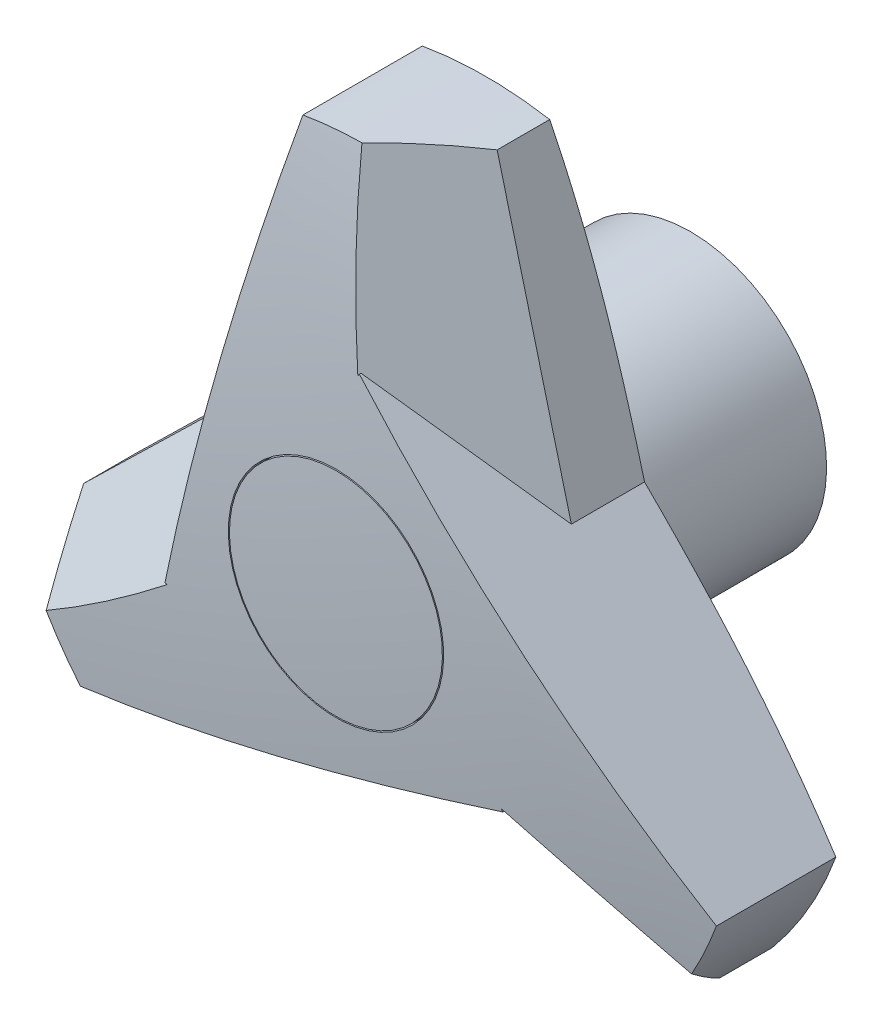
ISO-10303-21;
HEADER;
FILE_DESCRIPTION(('STEP AP214'),'2;1');
FILE_NAME('part.step','',(''),(''),'','','');
FILE_SCHEMA(('AUTOMOTIVE_DESIGN { 1 0 10303 214 1 1 1 1 }'));
ENDSEC;
DATA;
#1=APPLICATION_CONTEXT('core data for automotive mechanical design processes');
#2=APPLICATION_PROTOCOL_DEFINITION('international standard','automotive_design',2000,#1);
#3=PRODUCT_CONTEXT('',#1,'mechanical');
#4=PRODUCT('Part','Part','',(#3));
#5=PRODUCT_RELATED_PRODUCT_CATEGORY('part','',(#4));
#6=PRODUCT_DEFINITION_FORMATION('','',#4);
#7=PRODUCT_DEFINITION_CONTEXT('part definition',#1,'design');
#8=PRODUCT_DEFINITION('design','',#6,#7);
#9=PRODUCT_DEFINITION_SHAPE('','',#8);
#10=(LENGTH_UNIT() NAMED_UNIT(*) SI_UNIT(.MILLI.,.METRE.));
#11=(NAMED_UNIT(*) PLANE_ANGLE_UNIT() SI_UNIT($,.RADIAN.));
#12=(NAMED_UNIT(*) SI_UNIT($,.STERADIAN.) SOLID_ANGLE_UNIT());
#13=UNCERTAINTY_MEASURE_WITH_UNIT(LENGTH_MEASURE(1.E-05),#10,'distance_accuracy_value','');
#14=(GEOMETRIC_REPRESENTATION_CONTEXT(3) GLOBAL_UNCERTAINTY_ASSIGNED_CONTEXT((#13)) GLOBAL_UNIT_ASSIGNED_CONTEXT((#10,
#11,#12)) REPRESENTATION_CONTEXT('',''));
#15=CARTESIAN_POINT('',(0.,0.,0.));
#16=DIRECTION('',(0.,0.,1.));
#17=DIRECTION('',(1.,0.,0.));
#18=AXIS2_PLACEMENT_3D('',#15,#16,#17);
#19=CARTESIAN_POINT('',(0.,0.,145.669585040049));
#20=DIRECTION('',(0.,0.,-1.));
#21=DIRECTION('',(0.,1.,0.));
#22=AXIS2_PLACEMENT_3D('',#19,#20,#21);
#23=DEGENERATE_TOROIDAL_SURFACE('',#22,9.26275960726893,130.000000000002,.T.);
#24=CARTESIAN_POINT('',(0.,0.,17.5856081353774));
#25=DIRECTION('',(0.,0.,1.));
#26=DIRECTION('',(0.,-1.,0.));
#27=AXIS2_PLACEMENT_3D('',#24,#25,#26);
#28=CIRCLE('',#27,31.5);
#29=CARTESIAN_POINT('',(5.38147108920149,31.0369097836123,17.5856081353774));
#30=VERTEX_POINT('',#29);
#31=CARTESIAN_POINT('',(-5.38147108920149,31.0369097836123,17.5856081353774));
#32=VERTEX_POINT('',#31);
#33=EDGE_CURVE('E127',#30,#32,#28,.T.);
#34=ORIENTED_EDGE('',*,*,#33,.F.);
#35=CARTESIAN_POINT('',(11.544486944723,6.664983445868,15.7332351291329));
#36=CARTESIAN_POINT('',(11.4080792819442,7.20441374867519,15.7379922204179));
#37=CARTESIAN_POINT('',(11.2716740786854,7.74383432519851,15.7439991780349));
#38=CARTESIAN_POINT('',(10.9988716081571,8.82264409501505,15.7590912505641));
#39=CARTESIAN_POINT('',(10.8624743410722,9.36203328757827,15.7681764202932));
#40=CARTESIAN_POINT('',(10.4532787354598,10.9802159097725,15.8009188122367));
#41=CARTESIAN_POINT('',(10.1805041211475,12.0589155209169,15.8300621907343));
#42=CARTESIAN_POINT('',(9.63569132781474,14.213402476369,15.907195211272));
#43=CARTESIAN_POINT('',(9.36365281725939,15.289191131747,15.9551445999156));
#44=CARTESIAN_POINT('',(8.81986531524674,17.4396235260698,16.0729939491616));
#45=CARTESIAN_POINT('',(8.54811631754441,18.5142672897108,16.1428934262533));
#46=CARTESIAN_POINT('',(7.91814935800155,21.0055002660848,16.3329424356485));
#47=CARTESIAN_POINT('',(7.56008936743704,22.4214647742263,16.4620143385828));
#48=CARTESIAN_POINT('',(6.8450977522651,25.2489316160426,16.7648798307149));
#49=CARTESIAN_POINT('',(6.48816615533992,26.6604338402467,16.9386745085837));
#50=CARTESIAN_POINT('',(5.77484979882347,29.4812757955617,17.3330237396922));
#51=CARTESIAN_POINT('',(5.41846922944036,30.8905989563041,17.5537053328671));
#52=CARTESIAN_POINT('',(4.88536539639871,32.9987822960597,17.920159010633));
#53=CARTESIAN_POINT('',(4.70790109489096,33.7005729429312,18.0482216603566));
#54=CARTESIAN_POINT('',(4.35351036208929,35.1020272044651,18.3162059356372));
#55=CARTESIAN_POINT('',(4.17658393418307,35.8016908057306,18.4561276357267));
#56=CARTESIAN_POINT('',(3.99994942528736,36.5002,18.6020030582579));
#57=B_SPLINE_CURVE_WITH_KNOTS('',3,(#35,#36,#37,#38,#39,#40,#41,#42,#43,#44,#45,#46,#47,#48,#49,
#50,#51,#52,#53,#54,#55,#56),.UNSPECIFIED.,.F.,.F.,(4,2,2,2,2,2,2,2,2,2,4),(0.,1.6692892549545,
3.3386082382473,6.67758305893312,10.009449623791,13.3412428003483,17.7392456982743,
22.1373556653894,26.547537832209,28.7528167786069,30.9581095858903),.UNSPECIFIED.);
#58=CARTESIAN_POINT('',(11.5444363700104,6.66518344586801,15.7332368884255));
#59=VERTEX_POINT('',#58);
#60=EDGE_CURVE('E143',#59,#30,#57,.T.);
#61=ORIENTED_EDGE('',*,*,#60,.F.);
#62=CARTESIAN_POINT('',(33.610127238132,-14.7860928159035,18.6020177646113));
#63=CARTESIAN_POINT('',(33.102807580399,-14.2928993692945,18.4587652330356));
#64=CARTESIAN_POINT('',(32.5946644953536,-13.7989054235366,18.321253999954));
#65=CARTESIAN_POINT('',(31.5768586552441,-12.8094401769,18.0576688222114));
#66=CARTESIAN_POINT('',(31.0671959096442,-12.313968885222,17.931594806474));
#67=CARTESIAN_POINT('',(29.5362038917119,-10.8256070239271,17.5704803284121));
#68=CARTESIAN_POINT('',(28.5127769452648,-9.83067718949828,17.3525209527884));
#69=CARTESIAN_POINT('',(26.4639502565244,-7.83889965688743,16.9619085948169));
#70=CARTESIAN_POINT('',(25.438560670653,-6.84206183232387,16.789151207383));
#71=CARTESIAN_POINT('',(23.3845091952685,-4.84520499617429,16.4869004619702));
#72=CARTESIAN_POINT('',(22.3558473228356,-3.84518600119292,16.3574068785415));
#73=CARTESIAN_POINT('',(20.8129760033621,-2.34527561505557,16.1938410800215));
#74=CARTESIAN_POINT('',(20.2995699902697,-1.84616528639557,16.1444890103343));
#75=CARTESIAN_POINT('',(19.2723312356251,-0.847529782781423,16.0553618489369));
#76=CARTESIAN_POINT('',(18.7584984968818,-0.348004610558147,16.0155866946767));
#77=CARTESIAN_POINT('',(17.7305139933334,0.65135587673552,15.9449651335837));
#78=CARTESIAN_POINT('',(17.2163622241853,1.15119119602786,15.9141188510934));
#79=CARTESIAN_POINT('',(16.1878443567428,2.15107019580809,15.8605067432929));
#80=CARTESIAN_POINT('',(15.6734782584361,2.65111387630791,15.8377409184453));
#81=CARTESIAN_POINT('',(14.6443750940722,3.65156187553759,15.7992279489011));
#82=CARTESIAN_POINT('',(14.1296379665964,4.15196625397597,15.7834840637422));
#83=CARTESIAN_POINT('',(13.1000904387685,5.15284624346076,15.7578127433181));
#84=CARTESIAN_POINT('',(12.5852800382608,5.65332185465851,15.7478853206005));
#85=CARTESIAN_POINT('',(11.5556289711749,6.654302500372,15.7326205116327));
#86=CARTESIAN_POINT('',(11.0407883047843,7.15480753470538,15.7272830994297));
#87=CARTESIAN_POINT('',(10.0110960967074,8.15582817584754,15.7202321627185));
#88=CARTESIAN_POINT('',(9.49624455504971,8.65634378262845,15.7185186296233));
#89=CARTESIAN_POINT('',(8.66716640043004,9.46233642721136,15.7183844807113));
#90=CARTESIAN_POINT('',(8.35293965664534,9.76781359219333,15.7189408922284));
#91=CARTESIAN_POINT('',(7.7244912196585,10.3787630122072,15.721325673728));
#92=CARTESIAN_POINT('',(7.41026952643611,10.6842352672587,15.7231540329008));
#93=CARTESIAN_POINT('',(6.78189069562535,11.295117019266,15.7282192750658));
#94=CARTESIAN_POINT('',(6.46773355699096,11.6005265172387,15.7314558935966));
#95=CARTESIAN_POINT('',(5.8394293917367,12.2113356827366,15.7395521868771));
#96=CARTESIAN_POINT('',(5.52528236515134,12.5167353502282,15.7444118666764));
#97=CARTESIAN_POINT('',(4.58216068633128,13.4335960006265,15.761829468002));
#98=CARTESIAN_POINT('',(3.95320939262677,14.0450342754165,15.7772213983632));
#99=CARTESIAN_POINT('',(3.00983753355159,14.9621381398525,15.8076660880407));
#100=CARTESIAN_POINT('',(2.69535530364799,15.2678636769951,15.8190420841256));
#101=CARTESIAN_POINT('',(2.06644408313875,15.8792629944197,15.8445058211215));
#102=CARTESIAN_POINT('',(1.75201509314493,16.1849367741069,15.8585935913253));
#103=CARTESIAN_POINT('',(1.43762217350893,16.4905754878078,15.8741667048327));
#104=B_SPLINE_CURVE_WITH_KNOTS('',3,(#62,#63,#64,#65,#66,#67,#68,#69,#70,#71,#72,#73,#74,#75,
#76,#77,#78,#79,#80,#81,#82,#83,#84,#85,#86,#87,#88,#89,#90,#91,#92,#93,#94,#95,#96,#97,#98,#99,
#100,#101,#102,#103),.UNSPECIFIED.,.F.,.F.,(4,2,2,2,2,2,2,2,2,2,2,2,2,2,2,2,2,2,2,2,4),(0.,
2.16563848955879,4.33126351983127,8.66211296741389,12.9828691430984,17.3036028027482,
19.4567324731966,21.6098480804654,23.7629936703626,25.9161393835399,28.0702835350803,
30.2244323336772,32.3785689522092,34.532700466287,35.8474215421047,37.1621314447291,
38.4765945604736,39.7910617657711,42.4229414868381,43.7391670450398,45.0554068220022),.UNSPECIFIED.);
#105=CARTESIAN_POINT('',(29.5694878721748,-10.8579642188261,17.5856081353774));
#106=VERTEX_POINT('',#105);
#107=EDGE_CURVE('E142',#106,#59,#104,.T.);
#108=ORIENTED_EDGE('',*,*,#107,.F.);
#109=CARTESIAN_POINT('',(24.1880167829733,-20.1789455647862,17.5856081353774));
#110=VERTEX_POINT('',#109);
#111=EDGE_CURVE('E22',#110,#106,#28,.T.);
#112=ORIENTED_EDGE('',*,*,#111,.F.);
#113=CARTESIAN_POINT('',(-0.000199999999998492,-13.3303102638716,15.7332351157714));
#114=CARTESIAN_POINT('',(0.535164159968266,-13.4818929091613,15.737992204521));
#115=CARTESIAN_POINT('',(1.07051866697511,-13.633472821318,15.7439991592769));
#116=CARTESIAN_POINT('',(2.14119653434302,-13.9366238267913,15.7590912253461));
#117=CARTESIAN_POINT('',(2.67651989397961,-14.0881949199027,15.7681763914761));
#118=CARTESIAN_POINT('',(4.28250490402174,-14.5429124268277,15.8009187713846));
#119=CARTESIAN_POINT('',(5.35307344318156,-14.8460324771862,15.8300621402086));
#120=CARTESIAN_POINT('',(7.49132020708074,-15.4514542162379,15.9071951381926));
#121=CARTESIAN_POINT('',(8.55899973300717,-15.7537562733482,15.955144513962));
#122=CARTESIAN_POINT('',(10.6932224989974,-16.3580386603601,16.0729938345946));
#123=CARTESIAN_POINT('',(11.7597657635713,-16.6600189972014,16.1428932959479));
#124=CARTESIAN_POINT('',(14.2322205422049,-17.3600681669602,16.3329422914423));
#125=CARTESIAN_POINT('',(15.6375120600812,-17.7579614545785,16.462014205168));
#126=CARTESIAN_POINT('',(18.4436665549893,-18.552494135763,16.7648797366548));
#127=CARTESIAN_POINT('',(19.8445294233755,-18.9491334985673,16.9386744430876));
#128=CARTESIAN_POINT('',(22.644108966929,-19.7418045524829,17.3330237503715));
#129=CARTESIAN_POINT('',(24.0428091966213,-20.1378315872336,17.5537053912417));
#130=CARTESIAN_POINT('',(26.1351018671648,-20.7302419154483,17.920159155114));
#131=CARTESIAN_POINT('',(26.8316026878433,-20.9274486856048,18.0482218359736));
#132=CARTESIAN_POINT('',(28.2224933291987,-21.3212645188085,18.3162061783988));
#133=CARTESIAN_POINT('',(28.9168831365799,-21.5178735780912,18.4561279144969));
#134=CARTESIAN_POINT('',(29.610127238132,-21.7141582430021,18.602003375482));
#135=B_SPLINE_CURVE_WITH_KNOTS('',3,(#113,#114,#115,#116,#117,#118,#119,#120,#121,#122,#123,
#124,#125,#126,#127,#128,#129,#130,#131,#132,#133,#134),.UNSPECIFIED.,.F.,.F.,(4,2,2,2,2,2,2,2,
2,2,4),(0.,1.66928920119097,3.33860813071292,6.6775828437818,10.0094493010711,13.3412423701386,
17.7392461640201,22.1373570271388,26.5475400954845,28.7528194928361,30.9581127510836),.UNSPECIFIED.);
#136=CARTESIAN_POINT('',(0.,-13.330366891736,15.7332368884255));
#137=VERTEX_POINT('',#136);
#138=EDGE_CURVE('E140',#137,#110,#135,.T.);
#139=ORIENTED_EDGE('',*,*,#138,.F.);
#140=CARTESIAN_POINT('',(-29.610127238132,-21.7141582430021,18.602003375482));
#141=CARTESIAN_POINT('',(-28.9293507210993,-21.5214036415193,18.4587515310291));
#142=CARTESIAN_POINT('',(-28.2474692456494,-21.3283361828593,18.3212409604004));
#143=CARTESIAN_POINT('',(-26.881667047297,-20.9416238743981,18.0576570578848));
#144=CARTESIAN_POINT('',(-26.1977463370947,-20.7479790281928,17.9315836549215));
#145=CARTESIAN_POINT('',(-24.1432953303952,-20.1662831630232,17.5704709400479));
#146=CARTESIAN_POINT('',(-22.7699501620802,-19.7774351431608,17.3525126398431));
#147=CARTESIAN_POINT('',(-20.0206125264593,-18.9989895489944,16.9619022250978));
#148=CARTESIAN_POINT('',(-18.6446336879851,-18.6093958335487,16.7891457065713));
#149=CARTESIAN_POINT('',(-15.888284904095,-17.8289651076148,16.4868964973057));
#150=CARTESIAN_POINT('',(-14.5079149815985,-17.438128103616,16.3574035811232));
#151=CARTESIAN_POINT('',(-12.4375231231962,-16.8519187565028,16.193838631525));
#152=CARTESIAN_POINT('',(-11.7485793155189,-16.656851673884,16.14448681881));
#153=CARTESIAN_POINT('',(-10.3701190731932,-16.2665553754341,16.0553601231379));
#154=CARTESIAN_POINT('',(-9.68060264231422,-16.0713261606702,16.0155851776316));
#155=CARTESIAN_POINT('',(-8.3011416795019,-15.6807465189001,15.9449639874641));
#156=CARTESIAN_POINT('',(-7.61119714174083,-15.4853960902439,15.9141178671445));
#157=CARTESIAN_POINT('',(-6.23102045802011,-15.0946137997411,15.86050604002));
#158=CARTESIAN_POINT('',(-5.54078831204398,-14.8991819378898,15.8377403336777));
#159=CARTESIAN_POINT('',(-4.1598262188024,-14.5081772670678,15.7992275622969));
#160=CARTESIAN_POINT('',(-3.46909618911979,-14.3126044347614,15.7834837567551));
#161=CARTESIAN_POINT('',(-2.08753780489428,-13.9214309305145,15.7578125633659));
#162=CARTESIAN_POINT('',(-1.39670945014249,-13.7258302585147,15.747885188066));
#163=CARTESIAN_POINT('',(-0.0150121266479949,-13.3346174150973,15.7326204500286));
#164=CARTESIAN_POINT('',(0.675856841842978,-13.1390052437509,15.7272830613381));
#165=CARTESIAN_POINT('',(2.05760937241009,-12.7477767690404,15.7202321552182));
#166=CARTESIAN_POINT('',(2.74849293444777,-12.5521604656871,15.7185186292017));
#167=CARTESIAN_POINT('',(3.86103782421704,-12.237155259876,15.7183844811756));
#168=CARTESIAN_POINT('',(4.28269932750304,-12.1177663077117,15.7189408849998));
#169=CARTESIAN_POINT('',(5.12601555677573,-11.8789903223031,15.7213256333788));
#170=CARTESIAN_POINT('',(5.54767028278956,-11.7596032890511,15.7231539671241));
#171=CARTESIAN_POINT('',(6.39089310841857,-11.5208537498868,15.7282191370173));
#172=CARTESIAN_POINT('',(6.81246120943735,-11.4014912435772,15.7314557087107));
#173=CARTESIAN_POINT('',(7.65558384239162,-11.1627700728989,15.7395518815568));
#174=CARTESIAN_POINT('',(8.07713837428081,-11.0434114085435,15.7444114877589));
#175=CARTESIAN_POINT('',(9.34271525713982,-10.6850768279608,15.7618288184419));
#176=CARTESIAN_POINT('',(10.1867062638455,-10.4461097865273,15.7772205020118));
#177=CARTESIAN_POINT('',(11.4526188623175,-10.0876801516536,15.8076646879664));
#178=CARTESIAN_POINT('',(11.8746232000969,-9.96819412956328,15.8190404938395));
#179=CARTESIAN_POINT('',(12.7185604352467,-9.72924231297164,15.8445038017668));
#180=CARTESIAN_POINT('',(13.1404933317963,-9.60977651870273,15.8585913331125));
#181=CARTESIAN_POINT('',(13.5623778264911,-9.49032442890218,15.8741641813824));
#182=B_SPLINE_CURVE_WITH_KNOTS('',3,(#140,#141,#142,#143,#144,#145,#146,#147,#148,#149,#150,
#151,#152,#153,#154,#155,#156,#157,#158,#159,#160,#161,#162,#163,#164,#165,#166,#167,#168,#169,
#170,#171,#172,#173,#174,#175,#176,#177,#178,#179,#180,#181),.UNSPECIFIED.,.F.,.F.,(4,2,2,2,2,2,
2,2,2,2,2,2,2,2,2,2,2,2,2,2,4),(0.,2.16563390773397,4.33125435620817,8.66209464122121,
12.9828417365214,17.3035663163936,19.4566915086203,21.6098026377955,23.7629437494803,
25.9160849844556,28.070224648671,30.2243689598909,32.378501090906,34.5326281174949,
35.8473402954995,37.162041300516,38.4764955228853,39.7909538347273,42.4228157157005,
43.7390323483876,45.0552631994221),.UNSPECIFIED.);
#183=CARTESIAN_POINT('',(-24.1880167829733,-20.1789455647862,17.5856081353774));
#184=VERTEX_POINT('',#183);
#185=EDGE_CURVE('E132',#184,#137,#182,.T.);
#186=ORIENTED_EDGE('',*,*,#185,.F.);
#187=CARTESIAN_POINT('',(-29.5694878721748,-10.8579642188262,17.5856081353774));
#188=VERTEX_POINT('',#187);
#189=EDGE_CURVE('E118',#188,#184,#28,.T.);
#190=ORIENTED_EDGE('',*,*,#189,.F.);
#191=CARTESIAN_POINT('',(-11.5442363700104,6.6653778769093,15.7332345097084));
#192=CARTESIAN_POINT('',(-11.9431922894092,6.27753080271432,15.7379914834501));
#193=CARTESIAN_POINT('',(-12.342141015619,5.88969072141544,15.7439983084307));
#194=CARTESIAN_POINT('',(-13.1400152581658,5.11403312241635,15.7590900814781));
#195=CARTESIAN_POINT('',(-13.5389407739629,4.72621560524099,15.7681750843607));
#196=CARTESIAN_POINT('',(-14.7357284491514,3.56275223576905,15.8009169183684));
#197=CARTESIAN_POINT('',(-15.5335212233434,2.78717383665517,15.8300598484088));
#198=CARTESIAN_POINT('',(-17.1269529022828,1.23811093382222,15.9071918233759));
#199=CARTESIAN_POINT('',(-17.9225927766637,0.464625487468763,15.9551406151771));
#200=CARTESIAN_POINT('',(-19.5130257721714,-1.08152222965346,16.0729886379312));
#201=CARTESIAN_POINT('',(-20.3078189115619,-1.85418451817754,16.1428873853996));
#202=CARTESIAN_POINT('',(-22.1503152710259,-3.64537694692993,16.3329357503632));
#203=CARTESIAN_POINT('',(-23.1975564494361,-4.66345791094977,16.4620081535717));
#204=CARTESIAN_POINT('',(-25.2887385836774,-6.6964115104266,16.7648754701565));
#205=CARTESIAN_POINT('',(-26.3326794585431,-7.71128406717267,16.9386714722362));
#206=CARTESIAN_POINT('',(-28.4189618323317,-9.739474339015,17.3330242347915));
#207=CARTESIAN_POINT('',(-29.4612910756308,-10.7527801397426,17.553708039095));
#208=CARTESIAN_POINT('',(-31.0204942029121,-12.2685675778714,17.9201657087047));
#209=CARTESIAN_POINT('',(-31.539535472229,-12.7731562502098,18.0482298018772));
#210=CARTESIAN_POINT('',(-32.5760448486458,-13.780804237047,18.3162171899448));
#211=CARTESIAN_POINT('',(-33.0935129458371,-14.2838635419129,18.4561405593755));
#212=CARTESIAN_POINT('',(-33.610127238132,-14.7860928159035,18.6020177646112));
#213=B_SPLINE_CURVE_WITH_KNOTS('',3,(#191,#192,#193,#194,#195,#196,#197,#198,#199,#200,#201,
#202,#203,#204,#205,#206,#207,#208,#209,#210,#211,#212),.UNSPECIFIED.,.F.,.F.,(4,2,2,2,2,2,2,2,
2,2,4),(0.,1.66928676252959,3.33860325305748,6.67757308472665,10.0094346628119,13.3412228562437,
17.7392672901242,22.1374187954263,26.5476427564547,28.7529426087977,30.9582563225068),.UNSPECIFIED.);
#214=CARTESIAN_POINT('',(-11.5444363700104,6.665183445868,15.7332368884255));
#215=VERTEX_POINT('',#214);
#216=EDGE_CURVE('E128',#215,#188,#213,.T.);
#217=ORIENTED_EDGE('',*,*,#216,.F.);
#218=CARTESIAN_POINT('',(-3.99994942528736,36.5002,18.6020030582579));
#219=CARTESIAN_POINT('',(-4.17340729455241,35.8142529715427,18.4587512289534));
#220=CARTESIAN_POINT('',(-4.34714670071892,35.1271925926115,18.3212406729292));
#221=CARTESIAN_POINT('',(-4.69514510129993,33.7510170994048,18.0576567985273));
#222=CARTESIAN_POINT('',(-4.8694040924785,33.0619019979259,17.9315834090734));
#223=CARTESIAN_POINT('',(-5.39286617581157,30.9918473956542,17.5704707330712));
#224=CARTESIAN_POINT('',(-5.74278648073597,29.6080716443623,17.3525124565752));
#225=CARTESIAN_POINT('',(-6.44330160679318,26.8378527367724,16.9619020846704));
#226=CARTESIAN_POINT('',(-6.79389295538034,25.4514233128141,16.7891455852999));
#227=CARTESIAN_POINT('',(-7.49619448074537,22.6741400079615,16.4868964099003));
#228=CARTESIAN_POINT('',(-7.8479046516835,21.2832861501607,16.357403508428));
#229=CARTESIAN_POINT('',(-8.37542837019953,19.1971696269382,16.1938385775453));
#230=CARTESIAN_POINT('',(-8.55096721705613,18.5029932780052,16.1444867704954));
#231=CARTESIAN_POINT('',(-8.90219081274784,17.1140636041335,16.0553600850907));
#232=CARTESIAN_POINT('',(-9.07787556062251,16.4193102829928,16.0155851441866));
#233=CARTESIAN_POINT('',(-9.42935413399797,15.0293722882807,15.9449639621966));
#234=CARTESIAN_POINT('',(-9.60514796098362,14.3341876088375,15.9141178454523));
#235=CARTESIAN_POINT('',(-9.95680889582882,12.9435284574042,15.8605060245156));
#236=CARTESIAN_POINT('',(-10.1326760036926,12.2480539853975,15.8377403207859));
#237=CARTESIAN_POINT('',(-10.4845370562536,10.8566034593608,15.7992275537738));
#238=CARTESIAN_POINT('',(-10.6605310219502,10.1606273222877,15.7834837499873));
#239=CARTESIAN_POINT('',(-11.0125440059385,8.76857597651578,15.7578125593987));
#240=CARTESIAN_POINT('',(-11.1885630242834,8.07250076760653,15.7478851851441));
#241=CARTESIAN_POINT('',(-11.5406114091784,6.68030942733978,15.7326204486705));
#242=CARTESIAN_POINT('',(-11.7166407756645,5.98419329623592,15.7272830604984));
#243=CARTESIAN_POINT('',(-12.0687032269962,4.59194632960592,15.7202321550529));
#244=CARTESIAN_POINT('',(-12.2447363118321,3.89581549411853,15.7185186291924));
#245=CARTESIAN_POINT('',(-12.5282062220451,2.77482084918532,15.7183844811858));
#246=CARTESIAN_POINT('',(-12.6356430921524,2.34995686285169,15.7189408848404));
#247=CARTESIAN_POINT('',(-12.8505151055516,1.50023571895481,15.7213256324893));
#248=CARTESIAN_POINT('',(-12.9579502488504,1.0753785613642,15.723153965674));
#249=CARTESIAN_POINT('',(-13.1727984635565,0.225751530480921,15.7282191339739));
#250=CARTESIAN_POINT('',(-13.2802115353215,-0.199018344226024,15.7314557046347));
#251=CARTESIAN_POINT('',(-13.4950342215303,-1.04854442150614,15.7395518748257));
#252=CARTESIAN_POINT('',(-13.6024438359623,-1.47330062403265,15.7444114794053));
#253=CARTESIAN_POINT('',(-13.9249053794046,-2.74848945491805,15.7618288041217));
#254=CARTESIAN_POINT('',(-14.1399493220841,-3.59889050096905,15.7772204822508));
#255=CARTESIAN_POINT('',(-14.4624964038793,-4.8744175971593,15.8076646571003));
#256=CARTESIAN_POINT('',(-14.5700206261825,-5.29962702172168,15.8190404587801));
#257=CARTESIAN_POINT('',(-14.7850508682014,-6.14997388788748,15.8445037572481));
#258=CARTESIAN_POINT('',(-14.8925568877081,-6.5751113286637,15.858591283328));
#259=CARTESIAN_POINT('',(-15.0000505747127,-7.0002,15.8741641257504));
#260=B_SPLINE_CURVE_WITH_KNOTS('',3,(#218,#219,#220,#221,#222,#223,#224,#225,#226,#227,#228,
#229,#230,#231,#232,#233,#234,#235,#236,#237,#238,#239,#240,#241,#242,#243,#244,#245,#246,#247,
#248,#249,#250,#251,#252,#253,#254,#255,#256,#257,#258,#259),.UNSPECIFIED.,.F.,.F.,(4,2,2,2,2,2,
2,2,2,2,2,2,2,2,2,2,2,2,2,2,4),(0.,2.16563380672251,4.33125415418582,8.66209423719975,
12.9828411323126,17.3035655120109,19.4566906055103,21.6098016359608,23.7629426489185,
25.9160837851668,28.070223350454,30.2243675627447,32.3784995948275,34.5326265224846,
35.8473385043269,37.1620393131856,38.4764933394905,39.7909514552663,42.4228129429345,
43.7390293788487,45.055260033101),.UNSPECIFIED.);
#261=EDGE_CURVE('E147',#32,#215,#260,.T.);
#262=ORIENTED_EDGE('',*,*,#261,.F.);
#263=EDGE_LOOP('',(#34,#61,#108,#112,#139,#186,#190,#217,#262));
#264=FACE_BOUND('',#263,.T.);
#265=CARTESIAN_POINT('',(0.,0.,15.6888374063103));
#266=DIRECTION('',(0.,0.,1.));
#267=DIRECTION('',(0.,-1.,0.));
#268=AXIS2_PLACEMENT_3D('',#265,#266,#267);
#269=CIRCLE('',#268,11.5);
#270=CARTESIAN_POINT('',(0.,-11.5,15.6888374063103));
#271=VERTEX_POINT('',#270);
#272=EDGE_CURVE('E9',#271,#271,#269,.T.);
#273=ORIENTED_EDGE('',*,*,#272,.T.);
#274=EDGE_LOOP('',(#273));
#275=FACE_BOUND('',#274,.T.);
#276=ADVANCED_FACE('F14',(#264,#275),#23,.T.);
#277=CARTESIAN_POINT('',(-4.85177827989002,-16.8675659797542,17.0336297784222));
#278=DIRECTION('',(-0.198370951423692,-0.689651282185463,0.696441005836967));
#279=DIRECTION('',(0.,-0.710561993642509,-0.703634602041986));
#280=AXIS2_PLACEMENT_3D('',#277,#278,#279);
#281=PLANE('',#280);
#282=CARTESIAN_POINT('',(0.,0.,35.118708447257));
#283=DIRECTION('',(-0.198370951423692,-0.689651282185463,0.696441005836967));
#284=DIRECTION('',(-0.19251806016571,-0.66930327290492,-0.717614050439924));
#285=AXIS2_PLACEMENT_3D('',#282,#283,#284);
#286=ELLIPSE('',#285,45.2299616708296,31.5);
#287=CARTESIAN_POINT('',(27.4724471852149,-15.4115101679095,27.6825692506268));
#288=VERTEX_POINT('',#287);
#289=CARTESIAN_POINT('',(24.1880167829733,-20.1789455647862,22.026090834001));
#290=VERTEX_POINT('',#289);
#291=EDGE_CURVE('E195',#288,#290,#286,.F.);
#292=ORIENTED_EDGE('',*,*,#291,.F.);
#293=CARTESIAN_POINT('',(-25.1603670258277,-87.4718765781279,-58.6669492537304));
#294=DIRECTION('',(-0.198370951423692,-0.689651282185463,0.696441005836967));
#295=DIRECTION('',(0.,-0.710561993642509,-0.703634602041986));
#296=AXIS2_PLACEMENT_3D('',#293,#294,#295);
#297=CIRCLE('',#296,124.173865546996);
#298=CARTESIAN_POINT('',(13.4491335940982,-9.29458270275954,29.7455276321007));
#299=VERTEX_POINT('',#298);
#300=EDGE_CURVE('E249',#288,#299,#297,.T.);
#301=ORIENTED_EDGE('',*,*,#300,.T.);
#302=DIRECTION('',(0.406697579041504,-0.704420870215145,-0.581711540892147));
#303=VECTOR('',#302,1.);
#304=CARTESIAN_POINT('',(15.5990543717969,-13.0183547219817,26.6704325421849));
#305=LINE('',#304,#303);
#306=CARTESIAN_POINT('',(13.5621778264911,-9.49038105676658,29.5838371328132));
#307=VERTEX_POINT('',#306);
#308=EDGE_CURVE('E274',#299,#307,#305,.T.);
#309=ORIENTED_EDGE('',*,*,#308,.T.);
#310=DIRECTION('',(0.845264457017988,0.239327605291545,0.477755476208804));
#311=VECTOR('',#310,1.);
#312=CARTESIAN_POINT('',(-6.15459352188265,-15.0729743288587,18.439637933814));
#313=LINE('',#312,#311);
#314=CARTESIAN_POINT('',(0.,-13.330366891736,21.9183016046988));
#315=VERTEX_POINT('',#314);
#316=EDGE_CURVE('E265',#315,#307,#313,.T.);
#317=ORIENTED_EDGE('',*,*,#316,.F.);
#318=DIRECTION('',(0.962166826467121,-0.272427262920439,0.00428771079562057));
#319=VECTOR('',#318,1.);
#320=CARTESIAN_POINT('',(-13.5621778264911,-9.49038105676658,21.8578643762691));
#321=LINE('',#320,#319);
#322=EDGE_CURVE('E279',#315,#290,#321,.T.);
#323=ORIENTED_EDGE('',*,*,#322,.T.);
#324=EDGE_LOOP('',(#292,#301,#309,#317,#323));
#325=FACE_BOUND('',#324,.T.);
#326=ADVANCED_FACE('F174',(#325),#281,.T.);
#327=CARTESIAN_POINT('',(17.0336297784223,4.23201974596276,17.0336297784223));
#328=DIRECTION('',(0.696441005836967,0.173031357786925,0.696441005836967));
#329=DIRECTION('',(-0.707106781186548,0.,0.707106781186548));
#330=AXIS2_PLACEMENT_3D('',#327,#328,#329);
#331=PLANE('',#330);
#332=CARTESIAN_POINT('',(0.,0.,35.118708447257));
#333=DIRECTION('',(0.696441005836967,0.173031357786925,0.696441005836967));
#334=DIRECTION('',(0.675892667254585,0.167926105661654,-0.717614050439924));
#335=AXIS2_PLACEMENT_3D('',#332,#333,#334);
#336=ELLIPSE('',#335,45.2299616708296,31.5);
#337=CARTESIAN_POINT('',(-0.389464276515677,31.4975922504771,27.6825692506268));
#338=VERTEX_POINT('',#337);
#339=CARTESIAN_POINT('',(5.38147108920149,31.0369097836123,22.026090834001));
#340=VERTEX_POINT('',#339);
#341=EDGE_CURVE('E357',#338,#340,#336,.F.);
#342=ORIENTED_EDGE('',*,*,#341,.F.);
#343=CARTESIAN_POINT('',(88.3330507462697,21.9464212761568,-58.6669492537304));
#344=DIRECTION('',(0.696441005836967,0.173031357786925,0.696441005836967));
#345=DIRECTION('',(-0.707106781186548,0.,0.707106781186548));
#346=AXIS2_PLACEMENT_3D('',#343,#344,#345);
#347=CIRCLE('',#346,124.173865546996);
#348=CARTESIAN_POINT('',(1.32477794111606,16.2945827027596,29.7455276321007));
#349=VERTEX_POINT('',#348);
#350=EDGE_CURVE('E247',#338,#349,#347,.T.);
#351=ORIENTED_EDGE('',*,*,#350,.T.);
#352=DIRECTION('',(0.406697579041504,0.704420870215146,-0.581711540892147));
#353=VECTOR('',#352,1.);
#354=CARTESIAN_POINT('',(3.47469871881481,20.0183547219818,26.6704325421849));
#355=LINE('',#354,#353);
#356=CARTESIAN_POINT('',(1.43782217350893,16.4903810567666,29.5838371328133));
#357=VERTEX_POINT('',#356);
#358=EDGE_CURVE('E282',#349,#357,#355,.T.);
#359=ORIENTED_EDGE('',*,*,#358,.T.);
#360=DIRECTION('',(-0.629896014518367,0.612356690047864,0.477755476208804));
#361=VECTOR('',#360,1.);
#362=CARTESIAN_POINT('',(16.1308754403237,2.20645282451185,18.439637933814));
#363=LINE('',#362,#361);
#364=CARTESIAN_POINT('',(11.5444363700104,6.665183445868,21.9183016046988));
#365=VERTEX_POINT('',#364);
#366=EDGE_CURVE('E291',#365,#357,#363,.T.);
#367=ORIENTED_EDGE('',*,*,#366,.F.);
#368=DIRECTION('',(0.245154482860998,-0.9694745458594,-0.00428771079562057));
#369=VECTOR('',#368,1.);
#370=CARTESIAN_POINT('',(4.,36.5,22.0502525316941));
#371=LINE('',#370,#369);
#372=EDGE_CURVE('E287',#340,#365,#371,.T.);
#373=ORIENTED_EDGE('',*,*,#372,.F.);
#374=EDGE_LOOP('',(#342,#351,#359,#367,#373));
#375=FACE_BOUND('',#374,.T.);
#376=ADVANCED_FACE('F204',(#375),#331,.T.);
#377=CARTESIAN_POINT('',(-12.1818514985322,12.6355462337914,17.0336297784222));
#378=DIRECTION('',(-0.498070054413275,0.516619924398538,0.696441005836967));
#379=DIRECTION('',(0.,-0.803150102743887,0.595776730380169));
#380=AXIS2_PLACEMENT_3D('',#377,#378,#379);
#381=PLANE('',#380);
#382=CARTESIAN_POINT('',(0.,0.,35.118708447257));
#383=DIRECTION('',(-0.498070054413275,0.516619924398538,0.696441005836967));
#384=DIRECTION('',(-0.483374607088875,0.501377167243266,-0.717614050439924));
#385=AXIS2_PLACEMENT_3D('',#382,#383,#384);
#386=ELLIPSE('',#385,45.2299616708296,31.5);
#387=CARTESIAN_POINT('',(-27.0829829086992,-16.0860820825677,27.6825692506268));
#388=VERTEX_POINT('',#387);
#389=CARTESIAN_POINT('',(-29.5694878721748,-10.8579642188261,22.026090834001));
#390=VERTEX_POINT('',#389);
#391=EDGE_CURVE('E365',#388,#390,#386,.F.);
#392=ORIENTED_EDGE('',*,*,#391,.F.);
#393=CARTESIAN_POINT('',(-63.1726837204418,65.5254553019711,-58.6669492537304));
#394=DIRECTION('',(-0.498070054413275,0.516619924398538,0.696441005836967));
#395=DIRECTION('',(0.,-0.803150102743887,0.595776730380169));
#396=AXIS2_PLACEMENT_3D('',#393,#394,#395);
#397=CIRCLE('',#396,124.173865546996);
#398=CARTESIAN_POINT('',(-14.7739115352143,-7.,29.7455276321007));
#399=VERTEX_POINT('',#398);
#400=EDGE_CURVE('E236',#388,#399,#397,.T.);
#401=ORIENTED_EDGE('',*,*,#400,.T.);
#402=DIRECTION('',(-0.813395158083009,0.,-0.581711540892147));
#403=VECTOR('',#402,1.);
#404=CARTESIAN_POINT('',(-19.0737530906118,-7.,26.6704325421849));
#405=LINE('',#404,#403);
#406=CARTESIAN_POINT('',(-15.,-7.,29.5838371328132));
#407=VERTEX_POINT('',#406);
#408=EDGE_CURVE('E271',#399,#407,#405,.T.);
#409=ORIENTED_EDGE('',*,*,#408,.T.);
#410=DIRECTION('',(0.215368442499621,0.851684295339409,-0.477755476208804));
#411=VECTOR('',#410,1.);
#412=CARTESIAN_POINT('',(-9.97628191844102,12.8665215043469,18.439637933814));
#413=LINE('',#412,#411);
#414=CARTESIAN_POINT('',(-11.5444363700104,6.66518344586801,21.9183016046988));
#415=VERTEX_POINT('',#414);
#416=EDGE_CURVE('E268',#407,#415,#413,.T.);
#417=ORIENTED_EDGE('',*,*,#416,.T.);
#418=DIRECTION('',(-0.717012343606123,-0.697047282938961,0.00428771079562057));
#419=VECTOR('',#418,1.);
#420=CARTESIAN_POINT('',(-1.43782217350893,16.4903810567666,21.8578643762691));
#421=LINE('',#420,#419);
#422=EDGE_CURVE('E262',#415,#390,#421,.T.);
#423=ORIENTED_EDGE('',*,*,#422,.T.);
#424=EDGE_LOOP('',(#392,#401,#409,#417,#423));
#425=FACE_BOUND('',#424,.T.);
#426=ADVANCED_FACE('F202',(#425),#381,.T.);
#427=CARTESIAN_POINT('',(-12.4347448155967,3.14441822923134,0.));
#428=DIRECTION('',(-0.969483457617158,0.245156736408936,0.));
#429=DIRECTION('',(-0.245156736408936,-0.969483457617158,0.));
#430=AXIS2_PLACEMENT_3D('',#427,#428,#429);
#431=PLANE('',#430);
#432=DIRECTION('',(0.,0.,-1.));
#433=VECTOR('',#432,1.);
#434=CARTESIAN_POINT('',(-5.38147108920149,31.0369097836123,30.5));
#435=LINE('',#434,#433);
#436=CARTESIAN_POINT('',(-5.38147108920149,31.0369097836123,27.6825692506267));
#437=VERTEX_POINT('',#436);
#438=EDGE_CURVE('E370',#32,#437,#435,.F.);
#439=ORIENTED_EDGE('',*,*,#438,.F.);
#440=ORIENTED_EDGE('',*,*,#261,.T.);
#441=DIRECTION('',(0.,0.,-1.));
#442=VECTOR('',#441,1.);
#443=CARTESIAN_POINT('',(-11.5444363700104,6.66518344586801,0.));
#444=LINE('',#443,#442);
#445=EDGE_CURVE('E296',#415,#215,#444,.T.);
#446=ORIENTED_EDGE('',*,*,#445,.F.);
#447=ORIENTED_EDGE('',*,*,#416,.F.);
#448=DIRECTION('',(0.,0.,-1.));
#449=VECTOR('',#448,1.);
#450=CARTESIAN_POINT('',(-15.,-7.,36.));
#451=LINE('',#450,#449);
#452=CARTESIAN_POINT('',(-15.,-7.,29.7264835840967));
#453=VERTEX_POINT('',#452);
#454=EDGE_CURVE('E289',#453,#407,#451,.T.);
#455=ORIENTED_EDGE('',*,*,#454,.F.);
#456=CARTESIAN_POINT('',(-12.4347448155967,3.14441822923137,-147.));
#457=DIRECTION('',(-0.969483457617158,0.245156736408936,0.));
#458=DIRECTION('',(-0.245156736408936,-0.969483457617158,0.));
#459=AXIS2_PLACEMENT_3D('',#456,#457,#458);
#460=CIRCLE('',#459,177.035984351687);
#461=EDGE_CURVE('E244',#453,#437,#460,.T.);
#462=ORIENTED_EDGE('',*,*,#461,.T.);
#463=EDGE_LOOP('',(#439,#440,#446,#447,#455,#462));
#464=FACE_BOUND('',#463,.T.);
#465=ADVANCED_FACE('F197',(#464),#431,.T.);
#466=CARTESIAN_POINT('',(8.94051847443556,9.19659578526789,0.));
#467=DIRECTION('',(0.697053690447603,0.717018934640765,0.));
#468=DIRECTION('',(-0.717018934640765,0.697053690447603,0.));
#469=AXIS2_PLACEMENT_3D('',#466,#467,#468);
#470=PLANE('',#469);
#471=DIRECTION('',(0.,0.,-1.));
#472=VECTOR('',#471,1.);
#473=CARTESIAN_POINT('',(29.5694878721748,-10.8579642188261,30.5));
#474=LINE('',#473,#472);
#475=CARTESIAN_POINT('',(29.5694878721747,-10.8579642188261,27.6825692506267));
#476=VERTEX_POINT('',#475);
#477=EDGE_CURVE('E356',#106,#476,#474,.F.);
#478=ORIENTED_EDGE('',*,*,#477,.F.);
#479=ORIENTED_EDGE('',*,*,#107,.T.);
#480=DIRECTION('',(0.,0.,1.));
#481=VECTOR('',#480,1.);
#482=CARTESIAN_POINT('',(11.5444363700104,6.665183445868,0.));
#483=LINE('',#482,#481);
#484=EDGE_CURVE('E284',#59,#365,#483,.T.);
#485=ORIENTED_EDGE('',*,*,#484,.T.);
#486=ORIENTED_EDGE('',*,*,#366,.T.);
#487=DIRECTION('',(0.,0.,1.));
#488=VECTOR('',#487,1.);
#489=CARTESIAN_POINT('',(1.43782217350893,16.4903810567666,14.));
#490=LINE('',#489,#488);
#491=CARTESIAN_POINT('',(1.43782217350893,16.4903810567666,29.7264835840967));
#492=VERTEX_POINT('',#491);
#493=EDGE_CURVE('E276',#357,#492,#490,.T.);
#494=ORIENTED_EDGE('',*,*,#493,.T.);
#495=CARTESIAN_POINT('',(8.94051847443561,9.19659578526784,-147.));
#496=DIRECTION('',(0.697053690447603,0.717018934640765,0.));
#497=DIRECTION('',(-0.717018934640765,0.697053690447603,0.));
#498=AXIS2_PLACEMENT_3D('',#495,#496,#497);
#499=CIRCLE('',#498,177.035984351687);
#500=EDGE_CURVE('E254',#492,#476,#499,.T.);
#501=ORIENTED_EDGE('',*,*,#500,.T.);
#502=EDGE_LOOP('',(#478,#479,#485,#486,#494,#501));
#503=FACE_BOUND('',#502,.T.);
#504=ADVANCED_FACE('F201',(#503),#470,.T.);
#505=CARTESIAN_POINT('',(3.49422634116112,-12.3410140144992,0.));
#506=DIRECTION('',(0.272429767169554,-0.962175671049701,0.));
#507=DIRECTION('',(0.962175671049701,0.272429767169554,0.));
#508=AXIS2_PLACEMENT_3D('',#505,#506,#507);
#509=PLANE('',#508);
#510=DIRECTION('',(0.,0.,-1.));
#511=VECTOR('',#510,1.);
#512=CARTESIAN_POINT('',(-24.1880167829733,-20.1789455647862,30.5));
#513=LINE('',#512,#511);
#514=CARTESIAN_POINT('',(-24.1880167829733,-20.1789455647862,27.6825692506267));
#515=VERTEX_POINT('',#514);
#516=EDGE_CURVE('E121',#184,#515,#513,.F.);
#517=ORIENTED_EDGE('',*,*,#516,.F.);
#518=ORIENTED_EDGE('',*,*,#185,.T.);
#519=DIRECTION('',(0.,0.,1.));
#520=VECTOR('',#519,1.);
#521=CARTESIAN_POINT('',(0.,-13.330366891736,0.));
#522=LINE('',#521,#520);
#523=EDGE_CURVE('E294',#137,#315,#522,.T.);
#524=ORIENTED_EDGE('',*,*,#523,.T.);
#525=ORIENTED_EDGE('',*,*,#316,.T.);
#526=DIRECTION('',(0.,0.,1.));
#527=VECTOR('',#526,1.);
#528=CARTESIAN_POINT('',(13.5621778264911,-9.49038105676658,14.));
#529=LINE('',#528,#527);
#530=CARTESIAN_POINT('',(13.5621778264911,-9.49038105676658,29.7264835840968));
#531=VERTEX_POINT('',#530);
#532=EDGE_CURVE('E260',#307,#531,#529,.T.);
#533=ORIENTED_EDGE('',*,*,#532,.T.);
#534=CARTESIAN_POINT('',(3.49422634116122,-12.3410140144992,-147.));
#535=DIRECTION('',(0.272429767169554,-0.962175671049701,0.));
#536=DIRECTION('',(0.962175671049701,0.272429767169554,0.));
#537=AXIS2_PLACEMENT_3D('',#534,#535,#536);
#538=CIRCLE('',#537,177.035984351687);
#539=EDGE_CURVE('E135',#531,#515,#538,.T.);
#540=ORIENTED_EDGE('',*,*,#539,.T.);
#541=EDGE_LOOP('',(#517,#518,#524,#525,#533,#540));
#542=FACE_BOUND('',#541,.T.);
#543=ADVANCED_FACE('F131',(#542),#509,.T.);
#544=CARTESIAN_POINT('',(12.4347448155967,3.14441822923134,0.));
#545=DIRECTION('',(0.969483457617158,0.245156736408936,0.));
#546=DIRECTION('',(-0.245156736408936,0.969483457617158,0.));
#547=AXIS2_PLACEMENT_3D('',#544,#545,#546);
#548=PLANE('',#547);
#549=DIRECTION('',(0.,0.,-1.));
#550=VECTOR('',#549,1.);
#551=CARTESIAN_POINT('',(5.38147108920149,31.0369097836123,30.5));
#552=LINE('',#551,#550);
#553=EDGE_CURVE('E368',#340,#30,#552,.T.);
#554=ORIENTED_EDGE('',*,*,#553,.F.);
#555=ORIENTED_EDGE('',*,*,#372,.T.);
#556=ORIENTED_EDGE('',*,*,#484,.F.);
#557=ORIENTED_EDGE('',*,*,#60,.T.);
#558=EDGE_LOOP('',(#554,#555,#556,#557));
#559=FACE_BOUND('',#558,.T.);
#560=ADVANCED_FACE('F207',(#559),#548,.T.);
#561=CARTESIAN_POINT('',(-3.49422634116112,-12.3410140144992,0.));
#562=DIRECTION('',(-0.272429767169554,-0.962175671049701,0.));
#563=DIRECTION('',(0.962175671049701,-0.272429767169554,0.));
#564=AXIS2_PLACEMENT_3D('',#561,#562,#563);
#565=PLANE('',#564);
#566=DIRECTION('',(0.,0.,-1.));
#567=VECTOR('',#566,1.);
#568=CARTESIAN_POINT('',(24.1880167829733,-20.1789455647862,30.5));
#569=LINE('',#568,#567);
#570=EDGE_CURVE('E29',#290,#110,#569,.T.);
#571=ORIENTED_EDGE('',*,*,#570,.F.);
#572=ORIENTED_EDGE('',*,*,#322,.F.);
#573=ORIENTED_EDGE('',*,*,#523,.F.);
#574=ORIENTED_EDGE('',*,*,#138,.T.);
#575=EDGE_LOOP('',(#571,#572,#573,#574));
#576=FACE_BOUND('',#575,.T.);
#577=ADVANCED_FACE('F211',(#576),#565,.T.);
#578=CARTESIAN_POINT('',(-8.94051847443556,9.19659578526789,0.));
#579=DIRECTION('',(-0.697053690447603,0.717018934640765,0.));
#580=DIRECTION('',(-0.717018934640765,-0.697053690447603,0.));
#581=AXIS2_PLACEMENT_3D('',#578,#579,#580);
#582=PLANE('',#581);
#583=DIRECTION('',(0.,0.,-1.));
#584=VECTOR('',#583,1.);
#585=CARTESIAN_POINT('',(-29.5694878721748,-10.8579642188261,30.5));
#586=LINE('',#585,#584);
#587=EDGE_CURVE('E37',#390,#188,#586,.T.);
#588=ORIENTED_EDGE('',*,*,#587,.F.);
#589=ORIENTED_EDGE('',*,*,#422,.F.);
#590=ORIENTED_EDGE('',*,*,#445,.T.);
#591=ORIENTED_EDGE('',*,*,#216,.T.);
#592=EDGE_LOOP('',(#588,#589,#590,#591));
#593=FACE_BOUND('',#592,.T.);
#594=ADVANCED_FACE('F221',(#593),#582,.T.);
#595=CARTESIAN_POINT('',(0.,-7.,0.));
#596=DIRECTION('',(0.,-1.,0.));
#597=DIRECTION('',(1.,0.,0.));
#598=AXIS2_PLACEMENT_3D('',#595,#596,#597);
#599=PLANE('',#598);
#600=ORIENTED_EDGE('',*,*,#408,.F.);
#601=CARTESIAN_POINT('',(1.11022302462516E-13,-7.,-147.));
#602=DIRECTION('',(0.,-1.,0.));
#603=DIRECTION('',(1.,0.,0.));
#604=AXIS2_PLACEMENT_3D('',#601,#602,#603);
#605=CIRCLE('',#604,177.361918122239);
#606=EDGE_CURVE('E241',#399,#453,#605,.T.);
#607=ORIENTED_EDGE('',*,*,#606,.T.);
#608=ORIENTED_EDGE('',*,*,#454,.T.);
#609=EDGE_LOOP('',(#600,#607,#608));
#610=FACE_BOUND('',#609,.T.);
#611=ADVANCED_FACE('F16',(#610),#599,.T.);
#612=CARTESIAN_POINT('',(-6.06217782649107,3.5,0.));
#613=DIRECTION('',(0.866025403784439,-0.5,0.));
#614=DIRECTION('',(0.5,0.866025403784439,0.));
#615=AXIS2_PLACEMENT_3D('',#612,#613,#614);
#616=PLANE('',#615);
#617=CARTESIAN_POINT('',(-6.06217782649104,3.50000000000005,-147.));
#618=DIRECTION('',(0.866025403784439,-0.5,0.));
#619=DIRECTION('',(0.5,0.866025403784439,0.));
#620=AXIS2_PLACEMENT_3D('',#617,#618,#619);
#621=CIRCLE('',#620,177.361918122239);
#622=EDGE_CURVE('E251',#492,#349,#621,.T.);
#623=ORIENTED_EDGE('',*,*,#622,.F.);
#624=ORIENTED_EDGE('',*,*,#493,.F.);
#625=ORIENTED_EDGE('',*,*,#358,.F.);
#626=EDGE_LOOP('',(#623,#624,#625));
#627=FACE_BOUND('',#626,.T.);
#628=ADVANCED_FACE('F213',(#627),#616,.F.);
#629=CARTESIAN_POINT('',(6.06217782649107,3.5,0.));
#630=DIRECTION('',(-0.866025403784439,-0.5,0.));
#631=DIRECTION('',(0.5,-0.866025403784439,0.));
#632=AXIS2_PLACEMENT_3D('',#629,#630,#631);
#633=PLANE('',#632);
#634=CARTESIAN_POINT('',(6.0621778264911,3.49999999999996,-147.));
#635=DIRECTION('',(-0.866025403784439,-0.5,0.));
#636=DIRECTION('',(0.5,-0.866025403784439,0.));
#637=AXIS2_PLACEMENT_3D('',#634,#635,#636);
#638=CIRCLE('',#637,177.361918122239);
#639=EDGE_CURVE('E238',#531,#299,#638,.T.);
#640=ORIENTED_EDGE('',*,*,#639,.F.);
#641=ORIENTED_EDGE('',*,*,#532,.F.);
#642=ORIENTED_EDGE('',*,*,#308,.F.);
#643=EDGE_LOOP('',(#640,#641,#642));
#644=FACE_BOUND('',#643,.T.);
#645=ADVANCED_FACE('F216',(#644),#633,.F.);
#646=CARTESIAN_POINT('',(1.11022302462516E-13,0.,-147.));
#647=DIRECTION('',(0.,1.,0.));
#648=DIRECTION('',(-1.,0.,0.));
#649=AXIS2_PLACEMENT_3D('',#646,#647,#648);
#650=SPHERICAL_SURFACE('',#649,177.5);
#651=CARTESIAN_POINT('',(0.,0.,27.6825692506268));
#652=DIRECTION('',(0.,0.,-1.));
#653=DIRECTION('',(0.,1.,0.));
#654=AXIS2_PLACEMENT_3D('',#651,#652,#653);
#655=CIRCLE('',#654,31.5);
#656=EDGE_CURVE('E351',#476,#288,#655,.T.);
#657=ORIENTED_EDGE('',*,*,#656,.F.);
#658=ORIENTED_EDGE('',*,*,#500,.F.);
#659=ORIENTED_EDGE('',*,*,#622,.T.);
#660=ORIENTED_EDGE('',*,*,#350,.F.);
#661=EDGE_CURVE('E367',#437,#338,#655,.T.);
#662=ORIENTED_EDGE('',*,*,#661,.F.);
#663=ORIENTED_EDGE('',*,*,#461,.F.);
#664=ORIENTED_EDGE('',*,*,#606,.F.);
#665=ORIENTED_EDGE('',*,*,#400,.F.);
#666=EDGE_CURVE('E136',#515,#388,#655,.T.);
#667=ORIENTED_EDGE('',*,*,#666,.F.);
#668=ORIENTED_EDGE('',*,*,#539,.F.);
#669=ORIENTED_EDGE('',*,*,#639,.T.);
#670=ORIENTED_EDGE('',*,*,#300,.F.);
#671=EDGE_LOOP('',(#657,#658,#659,#660,#662,#663,#664,#665,#667,#668,#669,#670));
#672=FACE_BOUND('',#671,.T.);
#673=CARTESIAN_POINT('',(0.,0.,30.2665789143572));
#674=DIRECTION('',(0.,0.,-1.));
#675=DIRECTION('',(0.,1.,0.));
#676=AXIS2_PLACEMENT_3D('',#673,#674,#675);
#677=CIRCLE('',#676,9.1);
#678=CARTESIAN_POINT('',(0.,9.1,30.2665789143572));
#679=VERTEX_POINT('',#678);
#680=EDGE_CURVE('E234',#679,#679,#677,.F.);
#681=ORIENTED_EDGE('',*,*,#680,.F.);
#682=EDGE_LOOP('',(#681));
#683=FACE_BOUND('',#682,.T.);
#684=ADVANCED_FACE('F303',(#672,#683),#650,.T.);
#685=CARTESIAN_POINT('',(0.,9.1,27.5));
#686=DIRECTION('',(0.,0.,1.));
#687=DIRECTION('',(0.,-1.,0.));
#688=AXIS2_PLACEMENT_3D('',#685,#686,#687);
#689=PLANE('',#688);
#690=CARTESIAN_POINT('',(0.,0.,27.5));
#691=DIRECTION('',(0.,0.,-1.));
#692=DIRECTION('',(0.,1.,0.));
#693=AXIS2_PLACEMENT_3D('',#690,#691,#692);
#694=CIRCLE('',#693,9.);
#695=CARTESIAN_POINT('',(0.,9.,27.5));
#696=VERTEX_POINT('',#695);
#697=EDGE_CURVE('E228',#696,#696,#694,.T.);
#698=ORIENTED_EDGE('',*,*,#697,.T.);
#699=EDGE_LOOP('',(#698));
#700=FACE_BOUND('',#699,.T.);
#701=CARTESIAN_POINT('',(0.,0.,27.5));
#702=DIRECTION('',(0.,0.,-1.));
#703=DIRECTION('',(0.,1.,0.));
#704=AXIS2_PLACEMENT_3D('',#701,#702,#703);
#705=CIRCLE('',#704,9.1);
#706=CARTESIAN_POINT('',(0.,9.1,27.5));
#707=VERTEX_POINT('',#706);
#708=EDGE_CURVE('E257',#707,#707,#705,.T.);
#709=ORIENTED_EDGE('',*,*,#708,.F.);
#710=EDGE_LOOP('',(#709));
#711=FACE_BOUND('',#710,.T.);
#712=ADVANCED_FACE('F305',(#700,#711),#689,.T.);
#713=CARTESIAN_POINT('',(0.,0.,27.5));
#714=DIRECTION('',(0.,0.,-1.));
#715=DIRECTION('',(0.,1.,0.));
#716=AXIS2_PLACEMENT_3D('',#713,#714,#715);
#717=CYLINDRICAL_SURFACE('',#716,9.1);
#718=ORIENTED_EDGE('',*,*,#708,.T.);
#719=EDGE_LOOP('',(#718));
#720=FACE_BOUND('',#719,.T.);
#721=ORIENTED_EDGE('',*,*,#680,.T.);
#722=EDGE_LOOP('',(#721));
#723=FACE_BOUND('',#722,.T.);
#724=ADVANCED_FACE('F301',(#720,#723),#717,.F.);
#725=CARTESIAN_POINT('',(0.,0.,-147.000000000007));
#726=DIRECTION('',(0.,0.,-1.));
#727=DIRECTION('',(0.,1.,0.));
#728=AXIS2_PLACEMENT_3D('',#725,#726,#727);
#729=SPHERICAL_SURFACE('',#728,177.500000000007);
#730=CARTESIAN_POINT('',(0.,0.,30.2716841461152));
#731=DIRECTION('',(0.,0.,-1.));
#732=DIRECTION('',(0.,1.,0.));
#733=AXIS2_PLACEMENT_3D('',#730,#731,#732);
#734=CIRCLE('',#733,9.);
#735=CARTESIAN_POINT('',(0.,9.,30.2716841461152));
#736=VERTEX_POINT('',#735);
#737=EDGE_CURVE('E231',#736,#736,#734,.T.);
#738=ORIENTED_EDGE('',*,*,#737,.F.);
#739=EDGE_LOOP('',(#738));
#740=FACE_BOUND('',#739,.T.);
#741=ADVANCED_FACE('F318',(#740),#729,.T.);
#742=CARTESIAN_POINT('',(0.,0.,27.5));
#743=DIRECTION('',(0.,0.,-1.));
#744=DIRECTION('',(0.,1.,0.));
#745=AXIS2_PLACEMENT_3D('',#742,#743,#744);
#746=CYLINDRICAL_SURFACE('',#745,9.);
#747=ORIENTED_EDGE('',*,*,#697,.F.);
#748=EDGE_LOOP('',(#747));
#749=FACE_BOUND('',#748,.T.);
#750=ORIENTED_EDGE('',*,*,#737,.T.);
#751=EDGE_LOOP('',(#750));
#752=FACE_BOUND('',#751,.T.);
#753=ADVANCED_FACE('F176',(#749,#752),#746,.T.);
#754=CARTESIAN_POINT('',(0.,0.,30.5));
#755=DIRECTION('',(0.,0.,-1.));
#756=DIRECTION('',(0.,1.,0.));
#757=AXIS2_PLACEMENT_3D('',#754,#755,#756);
#758=CYLINDRICAL_SURFACE('',#757,31.5);
#759=ORIENTED_EDGE('',*,*,#391,.T.);
#760=ORIENTED_EDGE('',*,*,#587,.T.);
#761=ORIENTED_EDGE('',*,*,#189,.T.);
#762=ORIENTED_EDGE('',*,*,#516,.T.);
#763=ORIENTED_EDGE('',*,*,#666,.T.);
#764=EDGE_LOOP('',(#759,#760,#761,#762,#763));
#765=FACE_BOUND('',#764,.T.);
#766=ADVANCED_FACE('F120',(#765),#758,.T.);
#767=ORIENTED_EDGE('',*,*,#341,.T.);
#768=ORIENTED_EDGE('',*,*,#553,.T.);
#769=ORIENTED_EDGE('',*,*,#33,.T.);
#770=ORIENTED_EDGE('',*,*,#438,.T.);
#771=ORIENTED_EDGE('',*,*,#661,.T.);
#772=EDGE_LOOP('',(#767,#768,#769,#770,#771));
#773=FACE_BOUND('',#772,.T.);
#774=ADVANCED_FACE('F336',(#773),#758,.T.);
#775=ORIENTED_EDGE('',*,*,#291,.T.);
#776=ORIENTED_EDGE('',*,*,#570,.T.);
#777=ORIENTED_EDGE('',*,*,#111,.T.);
#778=ORIENTED_EDGE('',*,*,#477,.T.);
#779=ORIENTED_EDGE('',*,*,#656,.T.);
#780=EDGE_LOOP('',(#775,#776,#777,#778,#779));
#781=FACE_BOUND('',#780,.T.);
#782=ADVANCED_FACE('F337',(#781),#758,.T.);
#783=CARTESIAN_POINT('',(0.,0.,0.));
#784=DIRECTION('',(0.,0.,-1.));
#785=DIRECTION('',(0.,1.,0.));
#786=AXIS2_PLACEMENT_3D('',#783,#784,#785);
#787=CYLINDRICAL_SURFACE('',#786,11.5);
#788=CARTESIAN_POINT('',(0.,0.,0.3));
#789=DIRECTION('',(0.,0.,-1.));
#790=DIRECTION('',(0.,1.,0.));
#791=AXIS2_PLACEMENT_3D('',#788,#789,#790);
#792=CIRCLE('',#791,11.5);
#793=CARTESIAN_POINT('',(0.,11.5,0.3));
#794=VERTEX_POINT('',#793);
#795=EDGE_CURVE('E398',#794,#794,#792,.T.);
#796=ORIENTED_EDGE('',*,*,#795,.F.);
#797=EDGE_LOOP('',(#796));
#798=FACE_BOUND('',#797,.T.);
#799=ORIENTED_EDGE('',*,*,#272,.F.);
#800=EDGE_LOOP('',(#799));
#801=FACE_BOUND('',#800,.T.);
#802=ADVANCED_FACE('F344',(#798,#801),#787,.T.);
#803=CARTESIAN_POINT('',(11.5,0.,0.3));
#804=DIRECTION('',(0.,0.,1.));
#805=DIRECTION('',(0.,-1.,0.));
#806=AXIS2_PLACEMENT_3D('',#803,#804,#805);
#807=PLANE('',#806);
#808=CARTESIAN_POINT('',(0.,0.,0.3));
#809=DIRECTION('',(0.,0.,-1.));
#810=DIRECTION('',(0.,1.,0.));
#811=AXIS2_PLACEMENT_3D('',#808,#809,#810);
#812=CIRCLE('',#811,5.6);
#813=CARTESIAN_POINT('',(0.,5.6,0.3));
#814=VERTEX_POINT('',#813);
#815=EDGE_CURVE('E401',#814,#814,#812,.T.);
#816=ORIENTED_EDGE('',*,*,#815,.F.);
#817=EDGE_LOOP('',(#816));
#818=FACE_BOUND('',#817,.T.);
#819=ORIENTED_EDGE('',*,*,#795,.T.);
#820=EDGE_LOOP('',(#819));
#821=FACE_BOUND('',#820,.T.);
#822=ADVANCED_FACE('F348',(#818,#821),#807,.F.);
#823=CARTESIAN_POINT('',(0.,0.,0.));
#824=DIRECTION('',(0.,0.,-1.));
#825=DIRECTION('',(0.,1.,0.));
#826=AXIS2_PLACEMENT_3D('',#823,#824,#825);
#827=CYLINDRICAL_SURFACE('',#826,5.6);
#828=CARTESIAN_POINT('',(0.,0.,0.));
#829=DIRECTION('',(0.,0.,-1.));
#830=DIRECTION('',(0.,1.,0.));
#831=AXIS2_PLACEMENT_3D('',#828,#829,#830);
#832=CIRCLE('',#831,5.6);
#833=CARTESIAN_POINT('',(0.,5.6,0.));
#834=VERTEX_POINT('',#833);
#835=EDGE_CURVE('E406',#834,#834,#832,.T.);
#836=ORIENTED_EDGE('',*,*,#835,.F.);
#837=EDGE_LOOP('',(#836));
#838=FACE_BOUND('',#837,.T.);
#839=ORIENTED_EDGE('',*,*,#815,.T.);
#840=EDGE_LOOP('',(#839));
#841=FACE_BOUND('',#840,.T.);
#842=ADVANCED_FACE('F427',(#838,#841),#827,.T.);
#843=CARTESIAN_POINT('',(5.6,0.,0.));
#844=DIRECTION('',(0.,0.,1.));
#845=DIRECTION('',(0.,-1.,0.));
#846=AXIS2_PLACEMENT_3D('',#843,#844,#845);
#847=PLANE('',#846);
#848=CARTESIAN_POINT('',(0.,0.,0.));
#849=DIRECTION('',(0.,0.,-1.));
#850=DIRECTION('',(0.,1.,0.));
#851=AXIS2_PLACEMENT_3D('',#848,#849,#850);
#852=CIRCLE('',#851,4.);
#853=CARTESIAN_POINT('',(0.,4.,0.));
#854=VERTEX_POINT('',#853);
#855=EDGE_CURVE('E410',#854,#854,#852,.T.);
#856=ORIENTED_EDGE('',*,*,#855,.F.);
#857=EDGE_LOOP('',(#856));
#858=FACE_BOUND('',#857,.T.);
#859=ORIENTED_EDGE('',*,*,#835,.T.);
#860=EDGE_LOOP('',(#859));
#861=FACE_BOUND('',#860,.T.);
#862=ADVANCED_FACE('F421',(#858,#861),#847,.F.);
#863=CARTESIAN_POINT('',(0.,0.,13.));
#864=DIRECTION('',(0.,0.,-1.));
#865=DIRECTION('',(0.,1.,0.));
#866=AXIS2_PLACEMENT_3D('',#863,#864,#865);
#867=CYLINDRICAL_SURFACE('',#866,4.);
#868=CARTESIAN_POINT('',(0.,0.,13.));
#869=DIRECTION('',(0.,0.,-1.));
#870=DIRECTION('',(0.,1.,0.));
#871=AXIS2_PLACEMENT_3D('',#868,#869,#870);
#872=CIRCLE('',#871,4.);
#873=CARTESIAN_POINT('',(0.,4.,13.));
#874=VERTEX_POINT('',#873);
#875=EDGE_CURVE('E409',#874,#874,#872,.T.);
#876=ORIENTED_EDGE('',*,*,#875,.F.);
#877=EDGE_LOOP('',(#876));
#878=FACE_BOUND('',#877,.T.);
#879=ORIENTED_EDGE('',*,*,#855,.T.);
#880=EDGE_LOOP('',(#879));
#881=FACE_BOUND('',#880,.T.);
#882=ADVANCED_FACE('F418',(#878,#881),#867,.F.);
#883=CARTESIAN_POINT('',(0.,0.,13.));
#884=DIRECTION('',(0.,0.,-1.));
#885=DIRECTION('',(0.,1.,0.));
#886=AXIS2_PLACEMENT_3D('',#883,#884,#885);
#887=PLANE('',#886);
#888=ORIENTED_EDGE('',*,*,#875,.T.);
#889=EDGE_LOOP('',(#888));
#890=FACE_BOUND('',#889,.T.);
#891=ADVANCED_FACE('F416',(#890),#887,.T.);
#892=CLOSED_SHELL('',(#276,#326,#376,#426,#465,#504,#543,#560,#577,#594,#611,#628,#645,#684,
#712,#724,#741,#753,#766,#774,#782,#802,#822,#842,#862,#882,#891));
#893=MANIFOLD_SOLID_BREP('B1',#892);
#894=ADVANCED_BREP_SHAPE_REPRESENTATION('',(#18,#893),#14);
#895=SHAPE_DEFINITION_REPRESENTATION(#9,#894);
ENDSEC;
END-ISO-10303-21;
